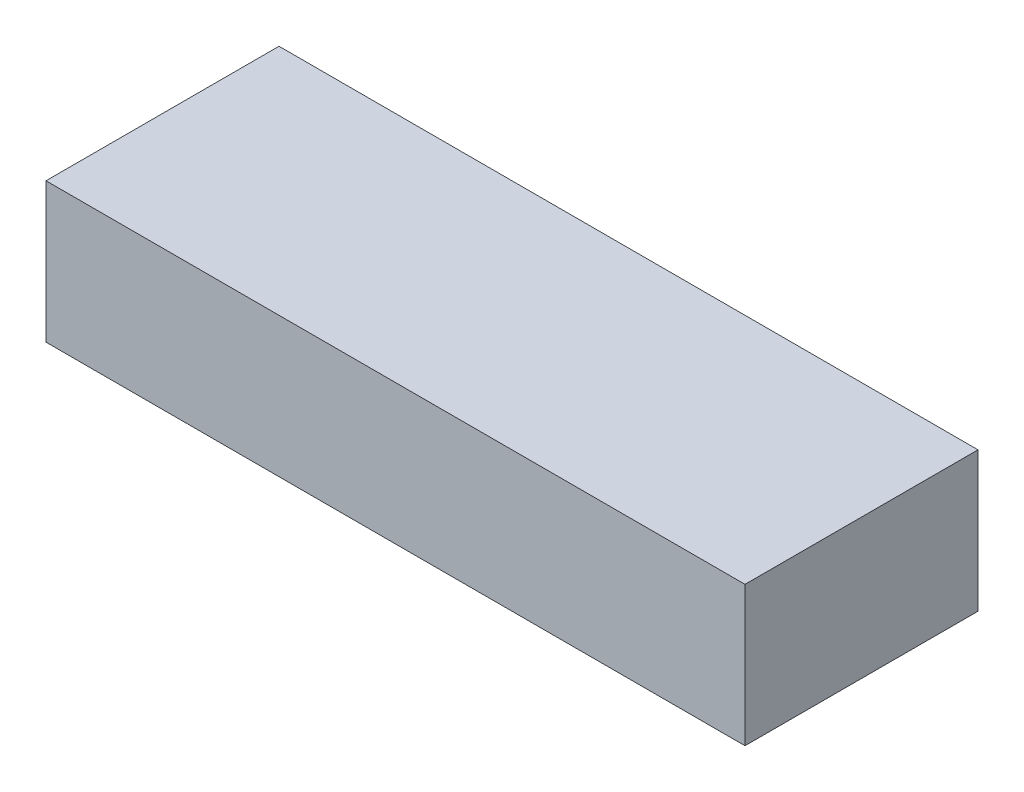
ISO-10303-21;
HEADER;
FILE_DESCRIPTION(('STEP AP214'),'2;1');
FILE_NAME('part.step','',(''),(''),'','','');
FILE_SCHEMA(('AUTOMOTIVE_DESIGN { 1 0 10303 214 1 1 1 1 }'));
ENDSEC;
DATA;
#1=APPLICATION_CONTEXT('core data for automotive mechanical design processes');
#2=APPLICATION_PROTOCOL_DEFINITION('international standard','automotive_design',2000,#1);
#3=PRODUCT_CONTEXT('',#1,'mechanical');
#4=PRODUCT('Part','Part','',(#3));
#5=PRODUCT_RELATED_PRODUCT_CATEGORY('part','',(#4));
#6=PRODUCT_DEFINITION_FORMATION('','',#4);
#7=PRODUCT_DEFINITION_CONTEXT('part definition',#1,'design');
#8=PRODUCT_DEFINITION('design','',#6,#7);
#9=PRODUCT_DEFINITION_SHAPE('','',#8);
#10=(LENGTH_UNIT() NAMED_UNIT(*) SI_UNIT(.MILLI.,.METRE.));
#11=(NAMED_UNIT(*) PLANE_ANGLE_UNIT() SI_UNIT($,.RADIAN.));
#12=(NAMED_UNIT(*) SI_UNIT($,.STERADIAN.) SOLID_ANGLE_UNIT());
#13=UNCERTAINTY_MEASURE_WITH_UNIT(LENGTH_MEASURE(1.E-05),#10,'distance_accuracy_value','');
#14=(GEOMETRIC_REPRESENTATION_CONTEXT(3) GLOBAL_UNCERTAINTY_ASSIGNED_CONTEXT((#13)) GLOBAL_UNIT_ASSIGNED_CONTEXT((#10,
#11,#12)) REPRESENTATION_CONTEXT('',''));
#15=CARTESIAN_POINT('',(0.,0.,0.));
#16=DIRECTION('',(0.,0.,1.));
#17=DIRECTION('',(1.,0.,0.));
#18=AXIS2_PLACEMENT_3D('',#15,#16,#17);
#19=CARTESIAN_POINT('',(0.,60.,0.));
#20=DIRECTION('',(1.,0.,0.));
#21=DIRECTION('',(0.,0.,-1.));
#22=AXIS2_PLACEMENT_3D('',#19,#20,#21);
#23=PLANE('',#22);
#24=DIRECTION('',(0.,0.,1.));
#25=VECTOR('',#24,1.);
#26=CARTESIAN_POINT('',(0.,0.,0.));
#27=LINE('',#26,#25);
#28=CARTESIAN_POINT('',(0.,0.,-100.));
#29=VERTEX_POINT('',#28);
#30=CARTESIAN_POINT('',(0.,0.,0.));
#31=VERTEX_POINT('',#30);
#32=EDGE_CURVE('E97',#29,#31,#27,.T.);
#33=ORIENTED_EDGE('',*,*,#32,.T.);
#34=DIRECTION('',(0.,-1.,0.));
#35=VECTOR('',#34,1.);
#36=CARTESIAN_POINT('',(0.,60.,0.));
#37=LINE('',#36,#35);
#38=CARTESIAN_POINT('',(0.,60.,0.));
#39=VERTEX_POINT('',#38);
#40=EDGE_CURVE('E11',#39,#31,#37,.T.);
#41=ORIENTED_EDGE('',*,*,#40,.F.);
#42=DIRECTION('',(0.,0.,1.));
#43=VECTOR('',#42,1.);
#44=CARTESIAN_POINT('',(0.,60.,0.));
#45=LINE('',#44,#43);
#46=CARTESIAN_POINT('',(0.,60.,-100.));
#47=VERTEX_POINT('',#46);
#48=EDGE_CURVE('E85',#47,#39,#45,.T.);
#49=ORIENTED_EDGE('',*,*,#48,.F.);
#50=DIRECTION('',(0.,-1.,0.));
#51=VECTOR('',#50,1.);
#52=CARTESIAN_POINT('',(0.,60.,-100.));
#53=LINE('',#52,#51);
#54=EDGE_CURVE('E93',#47,#29,#53,.T.);
#55=ORIENTED_EDGE('',*,*,#54,.T.);
#56=EDGE_LOOP('',(#33,#41,#49,#55));
#57=FACE_BOUND('',#56,.T.);
#58=ADVANCED_FACE('F34',(#57),#23,.F.);
#59=CARTESIAN_POINT('',(0.,60.,0.));
#60=DIRECTION('',(0.,0.,-1.));
#61=DIRECTION('',(-1.,0.,0.));
#62=AXIS2_PLACEMENT_3D('',#59,#60,#61);
#63=PLANE('',#62);
#64=DIRECTION('',(1.,0.,0.));
#65=VECTOR('',#64,1.);
#66=CARTESIAN_POINT('',(0.,0.,0.));
#67=LINE('',#66,#65);
#68=CARTESIAN_POINT('',(300.,0.,0.));
#69=VERTEX_POINT('',#68);
#70=EDGE_CURVE('E89',#31,#69,#67,.T.);
#71=ORIENTED_EDGE('',*,*,#70,.T.);
#72=DIRECTION('',(0.,-1.,0.));
#73=VECTOR('',#72,1.);
#74=CARTESIAN_POINT('',(300.,60.,0.));
#75=LINE('',#74,#73);
#76=CARTESIAN_POINT('',(300.,60.,0.));
#77=VERTEX_POINT('',#76);
#78=EDGE_CURVE('E42',#77,#69,#75,.T.);
#79=ORIENTED_EDGE('',*,*,#78,.F.);
#80=DIRECTION('',(1.,0.,0.));
#81=VECTOR('',#80,1.);
#82=CARTESIAN_POINT('',(0.,60.,0.));
#83=LINE('',#82,#81);
#84=EDGE_CURVE('E80',#39,#77,#83,.T.);
#85=ORIENTED_EDGE('',*,*,#84,.F.);
#86=ORIENTED_EDGE('',*,*,#40,.T.);
#87=EDGE_LOOP('',(#71,#79,#85,#86));
#88=FACE_BOUND('',#87,.T.);
#89=ADVANCED_FACE('F88',(#88),#63,.F.);
#90=CARTESIAN_POINT('',(300.,60.,0.));
#91=DIRECTION('',(-1.,0.,0.));
#92=DIRECTION('',(0.,0.,1.));
#93=AXIS2_PLACEMENT_3D('',#90,#91,#92);
#94=PLANE('',#93);
#95=DIRECTION('',(0.,0.,-1.));
#96=VECTOR('',#95,1.);
#97=CARTESIAN_POINT('',(300.,0.,0.));
#98=LINE('',#97,#96);
#99=CARTESIAN_POINT('',(300.,0.,-100.));
#100=VERTEX_POINT('',#99);
#101=EDGE_CURVE('E67',#69,#100,#98,.T.);
#102=ORIENTED_EDGE('',*,*,#101,.T.);
#103=DIRECTION('',(0.,-1.,0.));
#104=VECTOR('',#103,1.);
#105=CARTESIAN_POINT('',(300.,60.,-100.));
#106=LINE('',#105,#104);
#107=CARTESIAN_POINT('',(300.,60.,-100.));
#108=VERTEX_POINT('',#107);
#109=EDGE_CURVE('E90',#108,#100,#106,.T.);
#110=ORIENTED_EDGE('',*,*,#109,.F.);
#111=DIRECTION('',(0.,0.,-1.));
#112=VECTOR('',#111,1.);
#113=CARTESIAN_POINT('',(300.,60.,0.));
#114=LINE('',#113,#112);
#115=EDGE_CURVE('E83',#77,#108,#114,.T.);
#116=ORIENTED_EDGE('',*,*,#115,.F.);
#117=ORIENTED_EDGE('',*,*,#78,.T.);
#118=EDGE_LOOP('',(#102,#110,#116,#117));
#119=FACE_BOUND('',#118,.T.);
#120=ADVANCED_FACE('F91',(#119),#94,.F.);
#121=CARTESIAN_POINT('',(0.,60.,-100.));
#122=DIRECTION('',(0.,0.,1.));
#123=DIRECTION('',(1.,0.,0.));
#124=AXIS2_PLACEMENT_3D('',#121,#122,#123);
#125=PLANE('',#124);
#126=DIRECTION('',(-1.,0.,0.));
#127=VECTOR('',#126,1.);
#128=CARTESIAN_POINT('',(0.,0.,-100.));
#129=LINE('',#128,#127);
#130=EDGE_CURVE('E73',#100,#29,#129,.T.);
#131=ORIENTED_EDGE('',*,*,#130,.T.);
#132=ORIENTED_EDGE('',*,*,#54,.F.);
#133=DIRECTION('',(-1.,0.,0.));
#134=VECTOR('',#133,1.);
#135=CARTESIAN_POINT('',(0.,60.,-100.));
#136=LINE('',#135,#134);
#137=EDGE_CURVE('E50',#108,#47,#136,.T.);
#138=ORIENTED_EDGE('',*,*,#137,.F.);
#139=ORIENTED_EDGE('',*,*,#109,.T.);
#140=EDGE_LOOP('',(#131,#132,#138,#139));
#141=FACE_BOUND('',#140,.T.);
#142=ADVANCED_FACE('F104',(#141),#125,.F.);
#143=CARTESIAN_POINT('',(0.,60.,-100.));
#144=DIRECTION('',(0.,-1.,0.));
#145=DIRECTION('',(0.,0.,-1.));
#146=AXIS2_PLACEMENT_3D('',#143,#144,#145);
#147=PLANE('',#146);
#148=ORIENTED_EDGE('',*,*,#48,.T.);
#149=ORIENTED_EDGE('',*,*,#84,.T.);
#150=ORIENTED_EDGE('',*,*,#115,.T.);
#151=ORIENTED_EDGE('',*,*,#137,.T.);
#152=EDGE_LOOP('',(#148,#149,#150,#151));
#153=FACE_BOUND('',#152,.T.);
#154=ADVANCED_FACE('F81',(#153),#147,.F.);
#155=CARTESIAN_POINT('',(0.,0.,-100.));
#156=DIRECTION('',(0.,-1.,0.));
#157=DIRECTION('',(0.,0.,-1.));
#158=AXIS2_PLACEMENT_3D('',#155,#156,#157);
#159=PLANE('',#158);
#160=ORIENTED_EDGE('',*,*,#32,.F.);
#161=ORIENTED_EDGE('',*,*,#130,.F.);
#162=ORIENTED_EDGE('',*,*,#101,.F.);
#163=ORIENTED_EDGE('',*,*,#70,.F.);
#164=EDGE_LOOP('',(#160,#161,#162,#163));
#165=FACE_BOUND('',#164,.T.);
#166=ADVANCED_FACE('F107',(#165),#159,.T.);
#167=CLOSED_SHELL('',(#58,#89,#120,#142,#154,#166));
#168=MANIFOLD_SOLID_BREP('B2',#167);
#169=ADVANCED_BREP_SHAPE_REPRESENTATION('',(#18,#168),#14);
#170=SHAPE_DEFINITION_REPRESENTATION(#9,#169);
ENDSEC;
END-ISO-10303-21;
